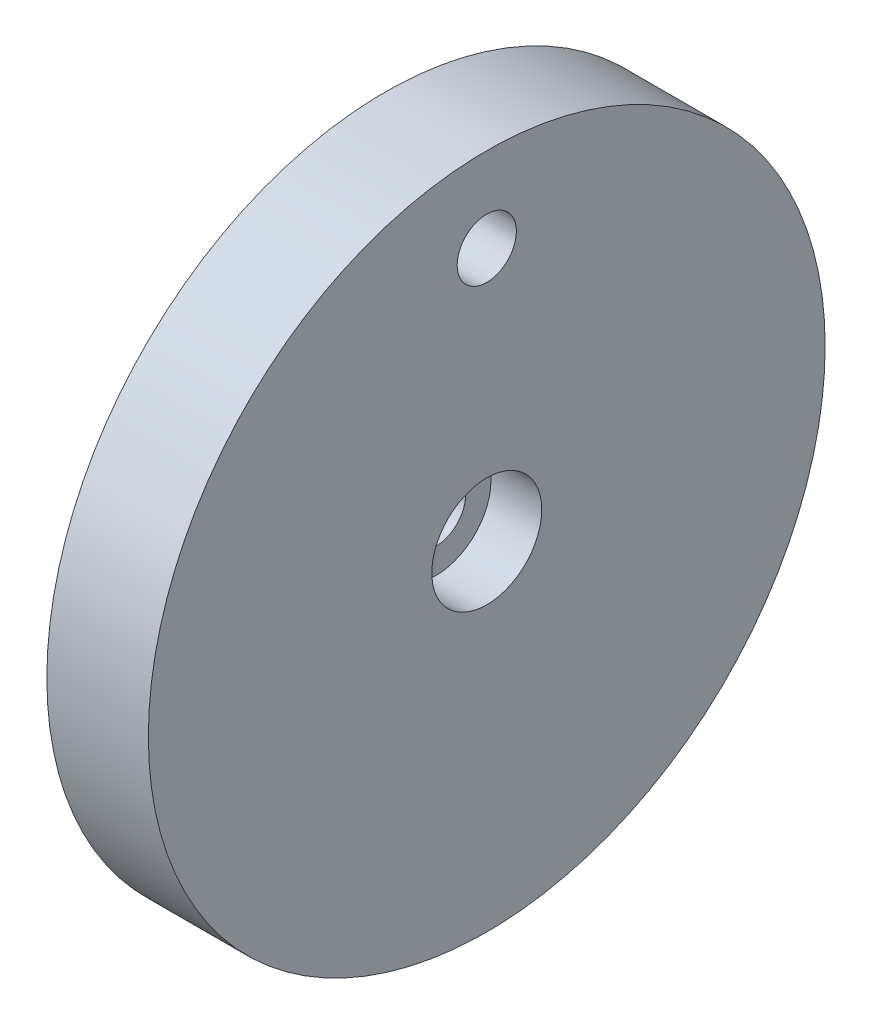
ISO-10303-21;
HEADER;
FILE_DESCRIPTION(('STEP AP214'),'2;1');
FILE_NAME('part.step','',(''),(''),'','','');
FILE_SCHEMA(('AUTOMOTIVE_DESIGN { 1 0 10303 214 1 1 1 1 }'));
ENDSEC;
DATA;
#1=APPLICATION_CONTEXT('core data for automotive mechanical design processes');
#2=APPLICATION_PROTOCOL_DEFINITION('international standard','automotive_design',2000,#1);
#3=PRODUCT_CONTEXT('',#1,'mechanical');
#4=PRODUCT('Part','Part','',(#3));
#5=PRODUCT_RELATED_PRODUCT_CATEGORY('part','',(#4));
#6=PRODUCT_DEFINITION_FORMATION('','',#4);
#7=PRODUCT_DEFINITION_CONTEXT('part definition',#1,'design');
#8=PRODUCT_DEFINITION('design','',#6,#7);
#9=PRODUCT_DEFINITION_SHAPE('','',#8);
#10=(LENGTH_UNIT() NAMED_UNIT(*) SI_UNIT(.MILLI.,.METRE.));
#11=(NAMED_UNIT(*) PLANE_ANGLE_UNIT() SI_UNIT($,.RADIAN.));
#12=(NAMED_UNIT(*) SI_UNIT($,.STERADIAN.) SOLID_ANGLE_UNIT());
#13=UNCERTAINTY_MEASURE_WITH_UNIT(LENGTH_MEASURE(1.E-05),#10,'distance_accuracy_value','');
#14=(GEOMETRIC_REPRESENTATION_CONTEXT(3) GLOBAL_UNCERTAINTY_ASSIGNED_CONTEXT((#13)) GLOBAL_UNIT_ASSIGNED_CONTEXT((#10,
#11,#12)) REPRESENTATION_CONTEXT('',''));
#15=CARTESIAN_POINT('',(0.,0.,0.));
#16=DIRECTION('',(0.,0.,1.));
#17=DIRECTION('',(1.,0.,0.));
#18=AXIS2_PLACEMENT_3D('',#15,#16,#17);
#19=CARTESIAN_POINT('',(6.,0.,0.));
#20=DIRECTION('',(-1.,0.,0.));
#21=DIRECTION('',(0.,0.,1.));
#22=AXIS2_PLACEMENT_3D('',#19,#20,#21);
#23=CYLINDRICAL_SURFACE('',#22,1.75);
#24=CARTESIAN_POINT('',(0.,0.,0.));
#25=DIRECTION('',(1.,0.,0.));
#26=DIRECTION('',(0.,0.,-1.));
#27=AXIS2_PLACEMENT_3D('',#24,#25,#26);
#28=CIRCLE('',#27,1.75);
#29=CARTESIAN_POINT('',(0.,0.,-1.75));
#30=VERTEX_POINT('',#29);
#31=EDGE_CURVE('E42',#30,#30,#28,.T.);
#32=ORIENTED_EDGE('',*,*,#31,.F.);
#33=EDGE_LOOP('',(#32));
#34=FACE_BOUND('',#33,.T.);
#35=CARTESIAN_POINT('',(3.,0.,0.));
#36=DIRECTION('',(1.,0.,0.));
#37=DIRECTION('',(0.,0.,-1.));
#38=AXIS2_PLACEMENT_3D('',#35,#36,#37);
#39=CIRCLE('',#38,1.75);
#40=CARTESIAN_POINT('',(3.,0.,-1.75));
#41=VERTEX_POINT('',#40);
#42=EDGE_CURVE('E33',#41,#41,#39,.T.);
#43=ORIENTED_EDGE('',*,*,#42,.T.);
#44=EDGE_LOOP('',(#43));
#45=FACE_BOUND('',#44,.T.);
#46=ADVANCED_FACE('F29',(#34,#45),#23,.F.);
#47=CARTESIAN_POINT('',(6.,15.,0.));
#48=DIRECTION('',(-1.,0.,0.));
#49=DIRECTION('',(0.,0.,1.));
#50=AXIS2_PLACEMENT_3D('',#47,#48,#49);
#51=CYLINDRICAL_SURFACE('',#50,1.75);
#52=CARTESIAN_POINT('',(6.,15.,0.));
#53=DIRECTION('',(1.,0.,0.));
#54=DIRECTION('',(0.,0.,-1.));
#55=AXIS2_PLACEMENT_3D('',#52,#53,#54);
#56=CIRCLE('',#55,1.75);
#57=CARTESIAN_POINT('',(6.,15.,-1.75));
#58=VERTEX_POINT('',#57);
#59=EDGE_CURVE('E48',#58,#58,#56,.T.);
#60=ORIENTED_EDGE('',*,*,#59,.T.);
#61=EDGE_LOOP('',(#60));
#62=FACE_BOUND('',#61,.T.);
#63=CARTESIAN_POINT('',(3.,15.,0.));
#64=DIRECTION('',(-1.,0.,0.));
#65=DIRECTION('',(0.,0.,1.));
#66=AXIS2_PLACEMENT_3D('',#63,#64,#65);
#67=CIRCLE('',#66,1.75);
#68=CARTESIAN_POINT('',(3.,15.,1.75));
#69=VERTEX_POINT('',#68);
#70=EDGE_CURVE('E46',#69,#69,#67,.T.);
#71=ORIENTED_EDGE('',*,*,#70,.T.);
#72=EDGE_LOOP('',(#71));
#73=FACE_BOUND('',#72,.T.);
#74=ADVANCED_FACE('F83',(#62,#73),#51,.F.);
#75=CARTESIAN_POINT('',(6.,0.,0.));
#76=DIRECTION('',(1.,0.,0.));
#77=DIRECTION('',(0.,0.,-1.));
#78=AXIS2_PLACEMENT_3D('',#75,#76,#77);
#79=PLANE('',#78);
#80=CARTESIAN_POINT('',(6.,0.,0.));
#81=DIRECTION('',(1.,0.,0.));
#82=DIRECTION('',(0.,0.,-1.));
#83=AXIS2_PLACEMENT_3D('',#80,#81,#82);
#84=CIRCLE('',#83,3.25);
#85=CARTESIAN_POINT('',(6.,0.,-3.25));
#86=VERTEX_POINT('',#85);
#87=EDGE_CURVE('E61',#86,#86,#84,.T.);
#88=ORIENTED_EDGE('',*,*,#87,.F.);
#89=EDGE_LOOP('',(#88));
#90=FACE_BOUND('',#89,.T.);
#91=CARTESIAN_POINT('',(6.,0.,0.));
#92=DIRECTION('',(1.,0.,0.));
#93=DIRECTION('',(0.,0.,-1.));
#94=AXIS2_PLACEMENT_3D('',#91,#92,#93);
#95=CIRCLE('',#94,20.);
#96=CARTESIAN_POINT('',(6.,0.,-20.));
#97=VERTEX_POINT('',#96);
#98=EDGE_CURVE('E10',#97,#97,#95,.T.);
#99=ORIENTED_EDGE('',*,*,#98,.T.);
#100=EDGE_LOOP('',(#99));
#101=FACE_BOUND('',#100,.T.);
#102=ORIENTED_EDGE('',*,*,#59,.F.);
#103=EDGE_LOOP('',(#102));
#104=FACE_BOUND('',#103,.T.);
#105=ADVANCED_FACE('F89',(#90,#101,#104),#79,.T.);
#106=CARTESIAN_POINT('',(0.,0.,0.));
#107=DIRECTION('',(1.,0.,0.));
#108=DIRECTION('',(0.,0.,-1.));
#109=AXIS2_PLACEMENT_3D('',#106,#107,#108);
#110=PLANE('',#109);
#111=CARTESIAN_POINT('',(0.,15.,0.));
#112=DIRECTION('',(-1.,0.,0.));
#113=DIRECTION('',(0.,0.,1.));
#114=AXIS2_PLACEMENT_3D('',#111,#112,#113);
#115=CIRCLE('',#114,3.25);
#116=CARTESIAN_POINT('',(0.,15.,3.25));
#117=VERTEX_POINT('',#116);
#118=EDGE_CURVE('E54',#117,#117,#115,.T.);
#119=ORIENTED_EDGE('',*,*,#118,.F.);
#120=EDGE_LOOP('',(#119));
#121=FACE_BOUND('',#120,.T.);
#122=ORIENTED_EDGE('',*,*,#31,.T.);
#123=EDGE_LOOP('',(#122));
#124=FACE_BOUND('',#123,.T.);
#125=CARTESIAN_POINT('',(0.,0.,0.));
#126=DIRECTION('',(1.,0.,0.));
#127=DIRECTION('',(0.,0.,-1.));
#128=AXIS2_PLACEMENT_3D('',#125,#126,#127);
#129=CIRCLE('',#128,20.);
#130=CARTESIAN_POINT('',(0.,0.,-20.));
#131=VERTEX_POINT('',#130);
#132=EDGE_CURVE('E37',#131,#131,#129,.T.);
#133=ORIENTED_EDGE('',*,*,#132,.F.);
#134=EDGE_LOOP('',(#133));
#135=FACE_BOUND('',#134,.T.);
#136=ADVANCED_FACE('F96',(#121,#124,#135),#110,.F.);
#137=CARTESIAN_POINT('',(6.,0.,0.));
#138=DIRECTION('',(-1.,0.,0.));
#139=DIRECTION('',(0.,0.,1.));
#140=AXIS2_PLACEMENT_3D('',#137,#138,#139);
#141=CYLINDRICAL_SURFACE('',#140,20.);
#142=ORIENTED_EDGE('',*,*,#98,.F.);
#143=EDGE_LOOP('',(#142));
#144=FACE_BOUND('',#143,.T.);
#145=ORIENTED_EDGE('',*,*,#132,.T.);
#146=EDGE_LOOP('',(#145));
#147=FACE_BOUND('',#146,.T.);
#148=ADVANCED_FACE('F31',(#144,#147),#141,.T.);
#149=CARTESIAN_POINT('',(3.,15.,0.));
#150=DIRECTION('',(-1.,0.,0.));
#151=DIRECTION('',(0.,0.,1.));
#152=AXIS2_PLACEMENT_3D('',#149,#150,#151);
#153=CYLINDRICAL_SURFACE('',#152,3.25);
#154=CARTESIAN_POINT('',(3.,15.,0.));
#155=DIRECTION('',(-1.,0.,0.));
#156=DIRECTION('',(0.,0.,1.));
#157=AXIS2_PLACEMENT_3D('',#154,#155,#156);
#158=CIRCLE('',#157,3.25);
#159=CARTESIAN_POINT('',(3.,15.,3.25));
#160=VERTEX_POINT('',#159);
#161=EDGE_CURVE('E49',#160,#160,#158,.T.);
#162=ORIENTED_EDGE('',*,*,#161,.F.);
#163=EDGE_LOOP('',(#162));
#164=FACE_BOUND('',#163,.T.);
#165=ORIENTED_EDGE('',*,*,#118,.T.);
#166=EDGE_LOOP('',(#165));
#167=FACE_BOUND('',#166,.T.);
#168=ADVANCED_FACE('F103',(#164,#167),#153,.F.);
#169=CARTESIAN_POINT('',(3.,15.,0.));
#170=DIRECTION('',(-1.,0.,0.));
#171=DIRECTION('',(0.,0.,1.));
#172=AXIS2_PLACEMENT_3D('',#169,#170,#171);
#173=PLANE('',#172);
#174=ORIENTED_EDGE('',*,*,#70,.F.);
#175=EDGE_LOOP('',(#174));
#176=FACE_BOUND('',#175,.T.);
#177=ORIENTED_EDGE('',*,*,#161,.T.);
#178=EDGE_LOOP('',(#177));
#179=FACE_BOUND('',#178,.T.);
#180=ADVANCED_FACE('F79',(#176,#179),#173,.T.);
#181=CARTESIAN_POINT('',(3.,0.,0.));
#182=DIRECTION('',(1.,0.,0.));
#183=DIRECTION('',(0.,0.,-1.));
#184=AXIS2_PLACEMENT_3D('',#181,#182,#183);
#185=CYLINDRICAL_SURFACE('',#184,3.25);
#186=CARTESIAN_POINT('',(3.,0.,0.));
#187=DIRECTION('',(1.,0.,0.));
#188=DIRECTION('',(0.,0.,-1.));
#189=AXIS2_PLACEMENT_3D('',#186,#187,#188);
#190=CIRCLE('',#189,3.25);
#191=CARTESIAN_POINT('',(3.,0.,-3.25));
#192=VERTEX_POINT('',#191);
#193=EDGE_CURVE('E64',#192,#192,#190,.T.);
#194=ORIENTED_EDGE('',*,*,#193,.F.);
#195=EDGE_LOOP('',(#194));
#196=FACE_BOUND('',#195,.T.);
#197=ORIENTED_EDGE('',*,*,#87,.T.);
#198=EDGE_LOOP('',(#197));
#199=FACE_BOUND('',#198,.T.);
#200=ADVANCED_FACE('F74',(#196,#199),#185,.F.);
#201=CARTESIAN_POINT('',(3.,0.,0.));
#202=DIRECTION('',(1.,0.,0.));
#203=DIRECTION('',(0.,0.,-1.));
#204=AXIS2_PLACEMENT_3D('',#201,#202,#203);
#205=PLANE('',#204);
#206=ORIENTED_EDGE('',*,*,#42,.F.);
#207=EDGE_LOOP('',(#206));
#208=FACE_BOUND('',#207,.T.);
#209=ORIENTED_EDGE('',*,*,#193,.T.);
#210=EDGE_LOOP('',(#209));
#211=FACE_BOUND('',#210,.T.);
#212=ADVANCED_FACE('F72',(#208,#211),#205,.T.);
#213=CLOSED_SHELL('',(#46,#74,#105,#136,#148,#168,#180,#200,#212));
#214=MANIFOLD_SOLID_BREP('B2',#213);
#215=ADVANCED_BREP_SHAPE_REPRESENTATION('',(#18,#214),#14);
#216=SHAPE_DEFINITION_REPRESENTATION(#9,#215);
ENDSEC;
END-ISO-10303-21;
